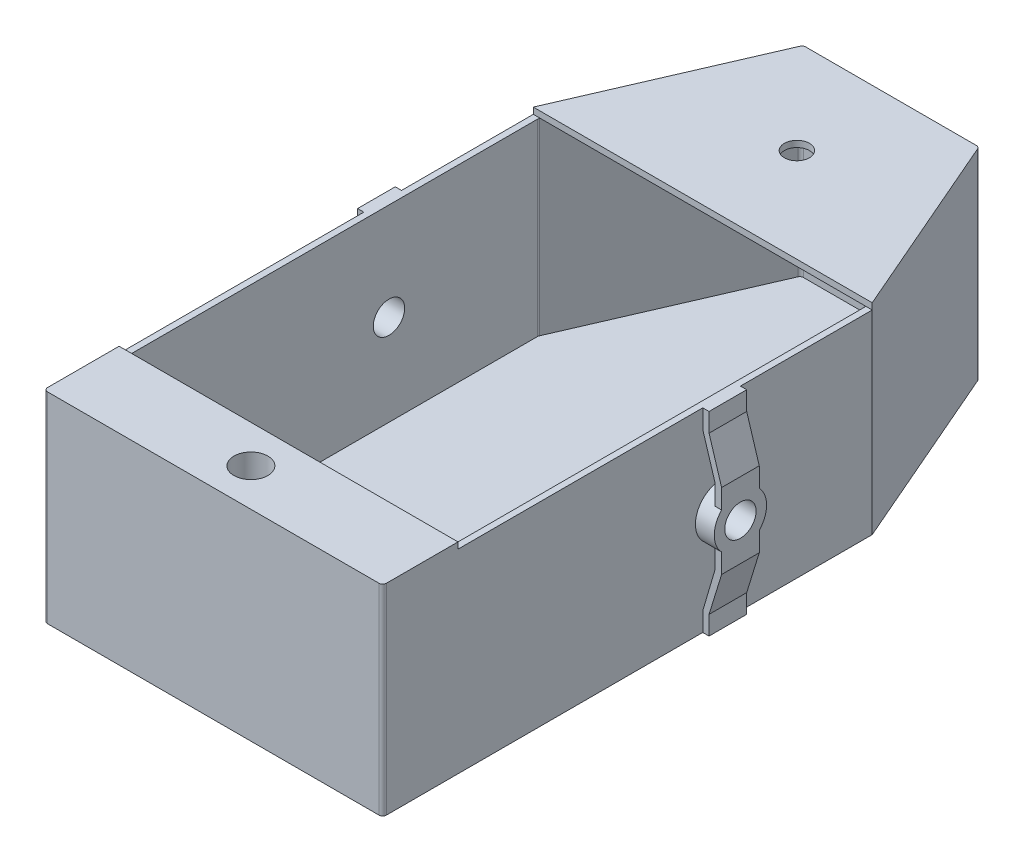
from build123d import *

# Parameters (mm, degrees)
BOSS_EXTRUDE5_DEPTH  = 5
BOSS_EXTRUDE6_DEPTH  = 150
BOSS_EXTRUDE7_DEPTH  = 5
SKETCH5_R            = 10
CUT_EXTRUDE1_DEPTH   = 5
BOSS_EXTRUDE9_DEPTH  = 5
BOSS_EXTRUDE10_DEPTH = 30
BOSS_EXTRUDE11_REACH = 425.94
SKETCH8_R            = 20.844598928
SKETCH9_R            = 12.5
CUT_EXTRUDE2_DEPTH   = 435.165866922
SKETCH10_W           = 270
SKETCH10_H           = 60
BOSS_EXTRUDE12_DEPTH = 5
SKETCH11_R           = 13.5
CUT_EXTRUDE4_DEPTH   = 5
SKETCH12_W           = 59.789866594
SKETCH12_H           = 40
BOSS_EXTRUDE13_DEPTH = 30
SKETCH13_R           = 13.5
CUT_EXTRUDE5_DEPTH   = 30
FILLET1_R            = 3


with BuildPart() as part:
    # Sketch1 → Boss-Extrude5 (new body)
    with BuildSketch(Plane(origin=(0, 0, 0), x_dir=(1, 0, 0), z_dir=(0, 1, 0))):
        Polygon((135, -270), (-135, -270), (-135, 120), (-70, 270), (70, 270), (135, 120), align=None)
    extrude(amount=BOSS_EXTRUDE5_DEPTH)

    # Sketch3 → Boss-Extrude6 (add)
    with BuildSketch(Plane(origin=(0, 5, 0), x_dir=(1, 0, 0), z_dir=(0, 1, 0))):
        Polygon((-70, 270), (-135, 120), (-135, -270), (135, -270), (135, 120), (70, 270), align=None)
        Polygon((66.717405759, 265), (-66.717405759, 265), (-130, 118.963244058), (-130, -265), (130, -265), (130, 118.963244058), align=None, mode=Mode.SUBTRACT)
    extrude(amount=BOSS_EXTRUDE6_DEPTH)

    # Sketch4 → Boss-Extrude7 (add)
    with BuildSketch(Plane(origin=(0, 155, 0), x_dir=(1, 0, 0), z_dir=(0, 1, 0))):
        Polygon((135, 120), (70, 270), (-70, 270), (-135, 120), align=None)
    extrude(amount=BOSS_EXTRUDE7_DEPTH)

    # Sketch5 → Cut-Extrude1 (cut)
    with BuildSketch(Plane(origin=(0, 160, 0), x_dir=(1, 0, 0), z_dir=(0, 1, 0))):
        with Locations(Location((0, 195, 0), (0, 0, 270))):
            Circle(SKETCH5_R)
    extrude(amount=-CUT_EXTRUDE1_DEPTH, mode=Mode.SUBTRACT)

    # Sketch6 → Boss-Extrude9 (add)
    with BuildSketch(Plane(origin=(135, 0, 0), x_dir=(0, 0, -1), z_dir=(1, 0, 0))):
        Polygon((0, 0), (15, 0), (15, 15), (-15, 15), (-15, 0), align=None)
        Polygon((-15, 140), (-15, 155), (0, 155), (15, 155), (15, 140), align=None)
    boss_extrude9 = extrude(amount=BOSS_EXTRUDE9_DEPTH)

    # Sketch7 → Boss-Extrude10 (add)
    with BuildSketch(Plane.XY.offset(15)):
        Polygon((150, 47.5), (150, 107.5), (140, 140), (135, 140), (144.567567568, 108.905405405), (144.567567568, 47.5), (135, 15), (140, 15), align=None)
    boss_extrude10 = extrude(amount=-BOSS_EXTRUDE10_DEPTH)

    # Sketch8 → Boss-Extrude11 (add, up to next)
    with BuildSketch(Plane(origin=(150, 0, 0), x_dir=(0, 0, -1), z_dir=(1, 0, 0)), mode=Mode.PRIVATE) as boss_extrude11_sk1:
        with Locations(Location((0, 77.5, 0), (0, 0, 43.977637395))):
            Circle(SKETCH8_R)
    boss_extrude11_tool1 = extrude(boss_extrude11_sk1.sketch, amount=-BOSS_EXTRUDE11_REACH, mode=Mode.PRIVATE) - part.part
    boss_extrude11 = boss_extrude11_tool1.solids().sort_by_distance((150, 77.5, 0))[0]
    add(boss_extrude11)

    # Mirror1: Boss-Extrude9, Boss-Extrude10, Boss-Extrude11 across plane
    add(boss_extrude9.mirror(Plane(origin=(0, 0, 0), x_dir=(0, 0, 1), z_dir=(1, 0, 0))))
    add(boss_extrude10.mirror(Plane(origin=(0, 0, 0), x_dir=(0, 0, 1), z_dir=(1, 0, 0))))
    add(boss_extrude11.mirror(Plane(origin=(0, 0, 0), x_dir=(0, 0, 1), z_dir=(1, 0, 0))))

    # Sketch9 → Cut-Extrude2 (cut, through all)
    with BuildSketch(Plane(origin=(150, 0, 0), x_dir=(0, 0, -1), z_dir=(1, 0, 0))):
        with Locations((0, 77.5)):
            Circle(SKETCH9_R)
    extrude(amount=-CUT_EXTRUDE2_DEPTH, mode=Mode.SUBTRACT)

    # Sketch10 → Boss-Extrude12 (add)
    with BuildSketch(Plane(origin=(0, 155, 0), x_dir=(1, 0, 0), z_dir=(0, 1, 0))):
        with Locations((0, -240)):
            Rectangle(SKETCH10_W, SKETCH10_H)
    extrude(amount=BOSS_EXTRUDE12_DEPTH)

    # Sketch11 → Cut-Extrude4 (cut)
    with BuildSketch(Plane(origin=(0, 160, 0), x_dir=(1, 0, 0), z_dir=(0, 1, 0))):
        with Locations(Location((0, -240, 0), (0, 0, 270))):
            Circle(SKETCH11_R)
    extrude(amount=-CUT_EXTRUDE4_DEPTH, mode=Mode.SUBTRACT)

    # Sketch12 → Boss-Extrude13 (add)
    with BuildSketch(Plane(origin=(0, 160, 0), x_dir=(1, 0, 0), z_dir=(0, 1, 0))):
        with Locations((0, -240)):
            Rectangle(SKETCH12_W, SKETCH12_H)
    extrude(amount=-BOSS_EXTRUDE13_DEPTH)

    # Sketch13 → Cut-Extrude5 (cut)
    with BuildSketch(Plane(origin=(0, 160, 0), x_dir=(1, 0, 0), z_dir=(0, 1, 0))):
        with Locations(Location((0, -240, 0), (0, 0, 270))):
            Circle(SKETCH13_R)
    extrude(amount=-CUT_EXTRUDE5_DEPTH, mode=Mode.SUBTRACT)

    # Fillet1
    fillet1_edges = [part.edges().sort_by_distance(p)[0] for p in [
        (135, 80, 270),
        (-135, 80, 270),
        (-70, 80, -270),
        (70, 80, -270),
        (66.717405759, 80, -265),
        (-66.717405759, 80, -265),
        (-130, 80, -118.963244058),
        (-130, 80, 265),
        (130, 80, 265),
        (130, 80, -118.963244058),
    ]]
    fillet(fillet1_edges, radius=FILLET1_R)


solid = part.part
